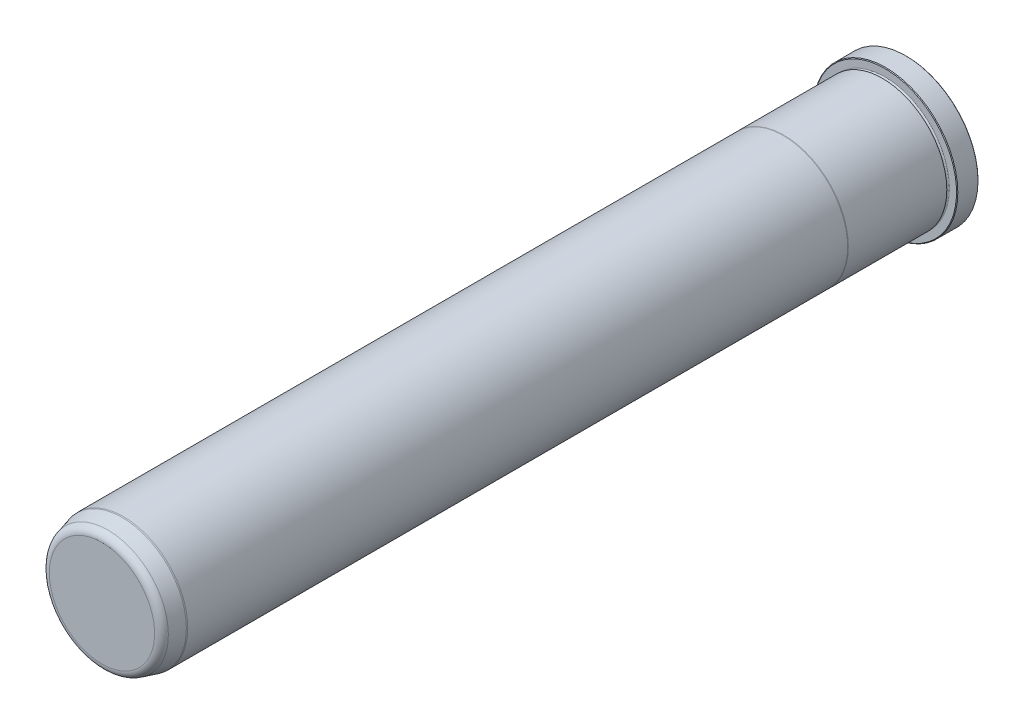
from build123d import *

# Parameters (mm, degrees)
FILLET6_R     = 4.7625
CHAMFER1_SIZE = 0.381


with BuildPart() as part:
    # Sketch1 → Revolve1 (revolve)
    with BuildSketch(Plane(origin=(0, 0, 0), x_dir=(0, 0, -1), z_dir=(1, 0, 0)), mode=Mode.PRIVATE) as revolve1_sk:
        with BuildLine():
            Line((0, 0), (0, 42.7355))
            Line((0, 42.7355), (-12.7, 42.7355))
            Line((-12.7, 42.7355), (-12.7, 38.0873))
            ThreePointArc((-12.7, 38.0873), (-13.462, 37.3253), (-14.224, 38.0873))
            Line((-14.224, 38.0873), (-14.224, 38.1127))
            Line((-14.224, 38.1127), (-72.534763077, 38.1127))
            Line((-72.534763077, 38.1127), (-72.898, 38.0873))
            Line((-72.898, 38.0873), (-463.55, 38.0873))
            Line((-463.55, 38.0873), (-464.312, 38.020633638))
            Line((-464.312, 38.020633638), (-476.25, 34.821856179))
            Line((-476.25, 34.821856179), (-476.25, 0))
            Line((-476.25, 0), (0, 0))
        make_face()
    revolve(revolve1_sk.sketch.rotate(Axis((0, 0, 0), (0, 0, -1)), 90), axis=Axis((0, 0, 0), (0, 0, -1)))

    # Fillet6
    fillet6_edges = [part.edges().sort_by_distance(p)[0] for p in [
        (-34.821856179, 0, 476.25),
    ]]
    fillet(fillet6_edges, radius=FILLET6_R)

    # Chamfer1
    chamfer1_edges = [part.edges().sort_by_distance(p)[0] for p in [
        (-42.7355, 0, 12.7),
        (-42.7355, 0, 0),
    ]]
    chamfer(chamfer1_edges, length=CHAMFER1_SIZE)


solid = part.part
